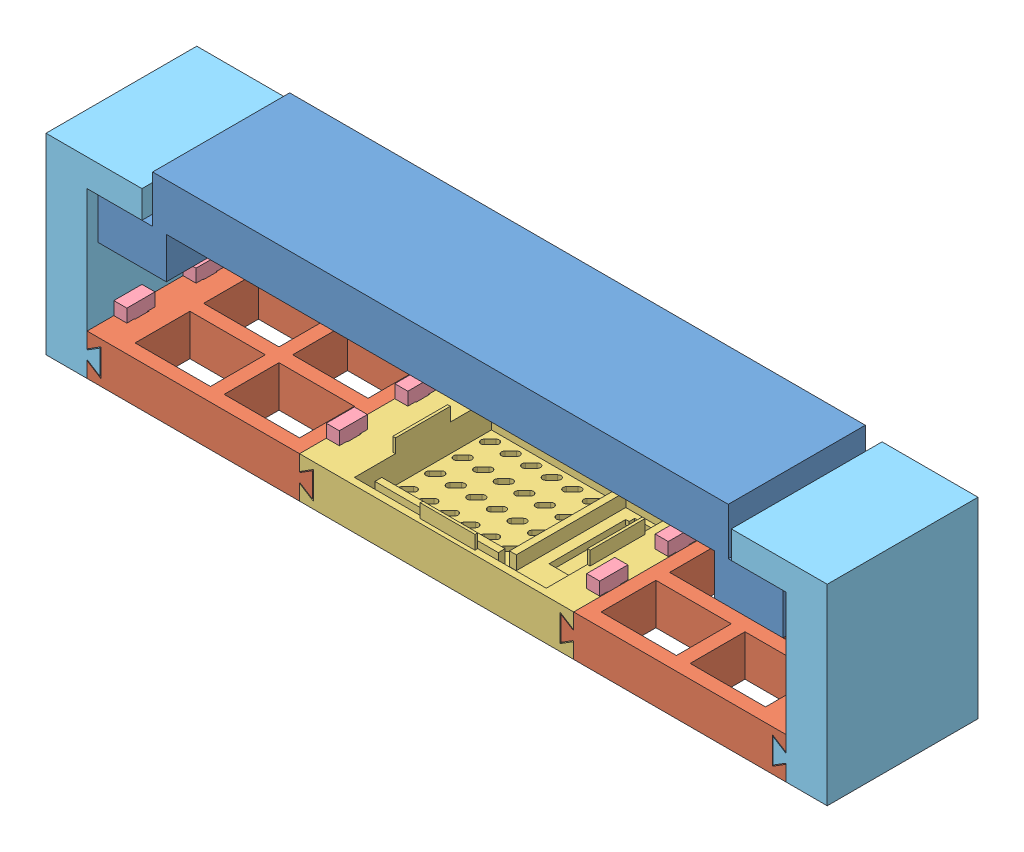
SolidWorks assembly assemblyPavilion.SLDASM, configuration Default (file format 15000). Lengths in mm.
Overall size (570 154.41 110).
14 component instances, 5 part files, 38 mates.
Components (placement in the parent):
- legde-1: legde.SLDPRT [Default] at (-40.027 247.5576 329.0632) size (500 64.41 100)
- connector-1: connector.SLDPRT [Default] at (107.1809 157.5576 319.0632) x (-1 0 0) z (0 -1 0) size (164.4 110 30)
- connector-2: connector.SLDPRT [Default] at (307.1809 127.5576 319.0632) x (1 0 0) z (0 1 0) size (164.4 110 30)
- middle-1: middle.SLDPRT [Default] at (137.1809 127.5576 319.0632) x (1 0 0) z (0 1 0) size (200 110 40)
- stopper-1: stopper.SLDPRT [Default] at (297.1809 167.0576 389.0532) size (9.5 39.5 20.52)
- stopper-2: stopper.SLDPRT [Default] at (-47.8191 167.0576 389.0532) size (9.5 39.5 20.52)
- stopper-3: stopper.SLDPRT [Default] at (-47.8191 167.0576 338.5532) size (9.5 39.5 20.52)
- stopper-4: stopper.SLDPRT [Default] at (107.1809 167.0576 339.0532) size (9.5 39.5 20.52)
- side-1: side.SLDPRT [Default] at (462.1809 247.5576 319.0632) size (70 140 110)
- side-2: side.SLDPRT [Default] at (-47.8191 247.5576 429.0632) x (-1 0 0) z (0 0 -1) size (70 140 110)
- stopper-5: stopper.SLDPRT [Default] at (107.1809 167.0576 389.0532) size (9.5 39.5 20.52)
- stopper-6: stopper.SLDPRT [Default] at (452.6809 167.0576 388.5532) size (9.5 39.5 20.52)
- stopper-7: stopper.SLDPRT [Default] at (452.1809 167.0576 339.0532) size (9.5 39.5 20.52)
- stopper-8: stopper.SLDPRT [Default] at (297.1809 167.0576 339.0532) size (9.5 39.5 20.52)
Mates (geometry in assembly coordinates):
- Coincident1: coincident aligned: plane of connector-2 through (307.1809 157.5576 429.0632) normal (0 0 1); plane of middle-1 through (137.1809 157.5576 429.0632) normal (0 0 1)
- Coincident2: coincident aligned: plane of connector-2 through (307.1809 157.5576 319.0632) normal (0 1 0); plane of middle-1 through (137.1809 157.5576 319.0632) normal (0 1 0)
- Coincident3: coincident anti-aligned: plane of connector-2 through (307.1809 157.5576 319.0632) normal (-1 0 0); plane of middle-1 through (307.1809 127.5576 319.0632) normal (1 0 0)
- Coincident4: coincident aligned: plane of connector-1 through (107.1809 127.5576 429.0632) normal (0 0 1); plane of middle-1 through (137.1809 157.5576 429.0632) normal (0 0 1)
- Coincident5: coincident aligned: plane of connector-1 through (107.1809 127.5576 319.0632) normal (0 -1 0); plane of middle-1 through (137.1809 127.5576 319.0632) normal (0 -1 0)
- Coincident6: coincident anti-aligned: plane of connector-1 through (107.1809 127.5576 319.0632) normal (1 0 0); plane of middle-1 through (107.1809 127.5576 319.0632) normal (-1 0 0)
- Coincident7: coincident aligned: plane of connector-2 through (307.1809 157.5576 429.0632) normal (0 0 1); plane of side-1 through (462.1809 247.5576 429.0632) normal (0 0 1)
- Coincident8: coincident aligned: plane of connector-2 through (307.1809 127.5576 319.0632) normal (0 -1 0); plane of side-1 through (462.1809 127.5576 429.0632) normal (0 -1 0)
- Coincident9: coincident anti-aligned: plane of connector-2 through (462.1809 157.5576 319.0632) normal (1 0 0); plane of side-1 through (462.1809 247.5576 429.0632) normal (-1 0 0)
- Coincident10: coincident aligned: plane of connector-1 through (107.1809 127.5576 429.0632) normal (0 0 1); plane of side-2 through (-47.8191 247.5576 429.0632) normal (0 0 1)
- Coincident11: coincident aligned: plane of connector-1 through (107.1809 127.5576 319.0632) normal (0 -1 0); plane of side-2 through (-47.8191 127.5576 319.0632) normal (0 -1 0)
- Coincident12: coincident anti-aligned: plane of connector-1 through (-47.8191 127.5576 319.0632) normal (-1 0 0); plane of side-2 through (-47.8191 247.5576 319.0632) normal (1 0 0)
- Coincident15: coincident anti-aligned: plane of middle-1 through (307.1809 115.0576 404.0632) normal (0 0 -1); plane of stopper-1 through (297.1809 127.5576 404.0632) normal (0 0 1)
- Coincident16: coincident anti-aligned: plane of middle-1 through (297.1809 115.0576 404.0632) normal (1 0 0); plane of stopper-1 through (297.1809 167.0576 409.5732) normal (-1 0 0)
- Coincident17: coincident anti-aligned: plane of middle-1 through (137.1809 157.5576 319.0632) normal (0 1 0); plane of stopper-1 through (297.1809 157.5576 409.5732) normal (0 -1 0)
- Coincident18: coincident anti-aligned: plane of middle-1 through (307.1809 115.0576 354.0632) normal (0 0 -1); plane of stopper-8 through (297.1809 127.5576 354.0632) normal (0 0 1)
- Coincident19: coincident anti-aligned: plane of middle-1 through (297.1809 115.0576 354.0632) normal (1 0 0); plane of stopper-8 through (297.1809 167.0576 359.5732) normal (-1 0 0)
- Coincident20: coincident anti-aligned: plane of middle-1 through (137.1809 157.5576 319.0632) normal (0 1 0); plane of stopper-8 through (297.1809 157.5576 359.5732) normal (0 -1 0)
- Coincident21: coincident anti-aligned: plane of connector-2 through (462.1809 107.5576 354.0632) normal (0 0 -1); plane of stopper-7 through (452.1809 127.5576 354.0632) normal (0 0 1)
- Coincident22: coincident anti-aligned: plane of connector-2 through (452.1809 107.5576 344.0632) normal (1 0 0); plane of stopper-7 through (452.1809 167.0576 359.5732) normal (-1 0 0)
- Coincident23: coincident anti-aligned: plane of connector-2 through (307.1809 157.5576 319.0632) normal (0 1 0); plane of stopper-7 through (452.1809 157.5576 359.5732) normal (0 -1 0)
- Coincident24: coincident anti-aligned: plane of connector-2 through (462.1809 107.5576 394.0632) normal (0 0 1); plane of stopper-6 through (452.6809 127.5576 394.0632) normal (0 0 -1)
- Coincident25: coincident anti-aligned: plane of side-1 through (462.1809 247.5576 429.0632) normal (-1 0 0); plane of stopper-6 through (462.1809 167.0576 409.0732) normal (1 0 0)
- Coincident26: coincident anti-aligned: plane of connector-2 through (307.1809 157.5576 319.0632) normal (0 1 0); plane of stopper-6 through (452.6809 157.5576 409.0732) normal (0 -1 0)
- Coincident27: coincident anti-aligned: plane of connector-1 through (107.1809 127.5576 319.0632) normal (1 0 0); plane of stopper-5 through (107.1809 167.0576 409.5732) normal (-1 0 0)
- Coincident28: coincident anti-aligned: plane of middle-1 through (107.1809 115.0576 404.0632) normal (0 0 -1); plane of stopper-5 through (107.1809 127.5576 404.0632) normal (0 0 1)
- Coincident29: coincident anti-aligned: plane of middle-1 through (137.1809 157.5576 319.0632) normal (0 1 0); plane of stopper-5 through (107.1809 157.5576 409.5732) normal (0 -1 0)
- Coincident30: coincident anti-aligned: plane of connector-1 through (107.1809 127.5576 319.0632) normal (1 0 0); plane of stopper-4 through (107.1809 167.0576 359.5732) normal (-1 0 0)
- Coincident31: coincident anti-aligned: plane of middle-1 through (107.1809 115.0576 354.0632) normal (0 0 -1); plane of stopper-4 through (107.1809 127.5576 354.0632) normal (0 0 1)
- Coincident32: coincident anti-aligned: plane of middle-1 through (137.1809 157.5576 319.0632) normal (0 1 0); plane of stopper-4 through (107.1809 157.5576 359.5732) normal (0 -1 0)
- Coincident33: coincident anti-aligned: plane of connector-1 through (-47.8191 177.5576 404.0632) normal (0 0 -1); plane of stopper-2 through (-47.8191 127.5576 404.0632) normal (0 0 1)
- Coincident34: coincident anti-aligned: plane of stopper-2 through (-47.8191 167.0576 409.5732) normal (-1 0 0); plane of side-2 through (-47.8191 247.5576 319.0632) normal (1 0 0)
- Coincident35: coincident anti-aligned: plane of connector-1 through (107.1809 157.5576 319.0632) normal (0 1 0); plane of stopper-2 through (-47.8191 157.5576 409.5732) normal (0 -1 0)
- Coincident36: coincident anti-aligned: plane of stopper-3 through (-47.8191 167.0576 359.0732) normal (-1 0 0); plane of side-2 through (-47.8191 247.5576 319.0632) normal (1 0 0)
- Coincident37: coincident anti-aligned: plane of connector-1 through (-47.8191 177.5576 344.0632) normal (0 0 1); plane of stopper-3 through (-47.8191 127.5576 344.0632) normal (0 0 -1)
- Coincident38: coincident anti-aligned: plane of connector-1 through (107.1809 157.5576 319.0632) normal (0 1 0); plane of stopper-3 through (-47.8191 157.5576 359.0732) normal (0 -1 0)
- Coincident40: coincident aligned: plane of legde-1 through (-40.027 247.5576 429.0632) normal (0 0 1); plane of side-2 through (-47.8191 247.5576 429.0632) normal (0 0 1)
- Coincident41: coincident anti-aligned: plane of legde-1 through (-40.027 247.5576 429.0632) normal (0 1 0); plane of side-2 through (-47.8191 247.5576 429.0632) normal (0 -1 0)
